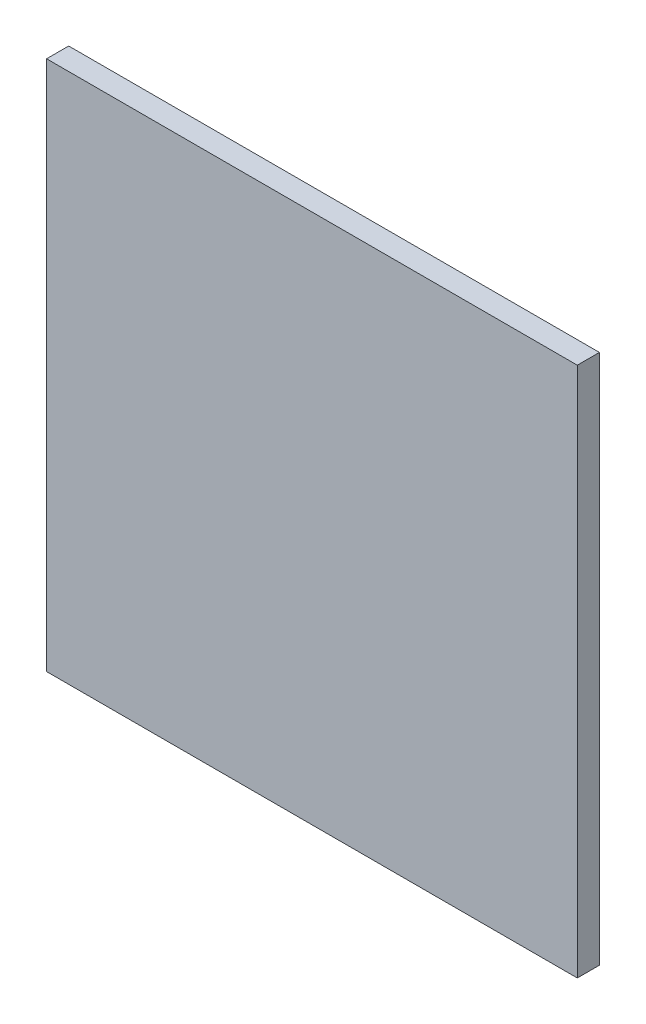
ISO-10303-21;
HEADER;
FILE_DESCRIPTION(('STEP AP214'),'2;1');
FILE_NAME('part.step','',(''),(''),'','','');
FILE_SCHEMA(('AUTOMOTIVE_DESIGN { 1 0 10303 214 1 1 1 1 }'));
ENDSEC;
DATA;
#1=APPLICATION_CONTEXT('core data for automotive mechanical design processes');
#2=APPLICATION_PROTOCOL_DEFINITION('international standard','automotive_design',2000,#1);
#3=PRODUCT_CONTEXT('',#1,'mechanical');
#4=PRODUCT('Part','Part','',(#3));
#5=PRODUCT_RELATED_PRODUCT_CATEGORY('part','',(#4));
#6=PRODUCT_DEFINITION_FORMATION('','',#4);
#7=PRODUCT_DEFINITION_CONTEXT('part definition',#1,'design');
#8=PRODUCT_DEFINITION('design','',#6,#7);
#9=PRODUCT_DEFINITION_SHAPE('','',#8);
#10=(LENGTH_UNIT() NAMED_UNIT(*) SI_UNIT(.MILLI.,.METRE.));
#11=(NAMED_UNIT(*) PLANE_ANGLE_UNIT() SI_UNIT($,.RADIAN.));
#12=(NAMED_UNIT(*) SI_UNIT($,.STERADIAN.) SOLID_ANGLE_UNIT());
#13=UNCERTAINTY_MEASURE_WITH_UNIT(LENGTH_MEASURE(1.E-05),#10,'distance_accuracy_value','');
#14=(GEOMETRIC_REPRESENTATION_CONTEXT(3) GLOBAL_UNCERTAINTY_ASSIGNED_CONTEXT((#13)) GLOBAL_UNIT_ASSIGNED_CONTEXT((#10,
#11,#12)) REPRESENTATION_CONTEXT('',''));
#15=CARTESIAN_POINT('',(0.,0.,0.));
#16=DIRECTION('',(0.,0.,1.));
#17=DIRECTION('',(1.,0.,0.));
#18=AXIS2_PLACEMENT_3D('',#15,#16,#17);
#19=CARTESIAN_POINT('',(-38.1,38.1,1.5875));
#20=DIRECTION('',(0.,0.,1.));
#21=DIRECTION('',(1.,0.,0.));
#22=AXIS2_PLACEMENT_3D('',#19,#20,#21);
#23=PLANE('',#22);
#24=DIRECTION('',(1.,0.,0.));
#25=VECTOR('',#24,1.);
#26=CARTESIAN_POINT('',(38.1,-38.1,1.5875));
#27=LINE('',#26,#25);
#28=CARTESIAN_POINT('',(38.1,-38.1,1.5875));
#29=VERTEX_POINT('',#28);
#30=CARTESIAN_POINT('',(-38.1,-38.1,1.5875));
#31=VERTEX_POINT('',#30);
#32=EDGE_CURVE('E19',#29,#31,#27,.F.);
#33=ORIENTED_EDGE('',*,*,#32,.F.);
#34=DIRECTION('',(0.,1.,0.));
#35=VECTOR('',#34,1.);
#36=CARTESIAN_POINT('',(38.1,38.1,1.5875));
#37=LINE('',#36,#35);
#38=CARTESIAN_POINT('',(38.1,38.1,1.5875));
#39=VERTEX_POINT('',#38);
#40=EDGE_CURVE('E57',#39,#29,#37,.F.);
#41=ORIENTED_EDGE('',*,*,#40,.F.);
#42=DIRECTION('',(1.,0.,0.));
#43=VECTOR('',#42,1.);
#44=CARTESIAN_POINT('',(-38.1,38.1,1.5875));
#45=LINE('',#44,#43);
#46=CARTESIAN_POINT('',(-38.1,38.1,1.5875));
#47=VERTEX_POINT('',#46);
#48=EDGE_CURVE('E52',#47,#39,#45,.T.);
#49=ORIENTED_EDGE('',*,*,#48,.F.);
#50=DIRECTION('',(0.,1.,0.));
#51=VECTOR('',#50,1.);
#52=CARTESIAN_POINT('',(-38.1,-38.1,1.5875));
#53=LINE('',#52,#51);
#54=EDGE_CURVE('E67',#31,#47,#53,.T.);
#55=ORIENTED_EDGE('',*,*,#54,.F.);
#56=EDGE_LOOP('',(#33,#41,#49,#55));
#57=FACE_BOUND('',#56,.T.);
#58=ADVANCED_FACE('F16',(#57),#23,.T.);
#59=CARTESIAN_POINT('',(38.1,-38.1,-1.5875));
#60=DIRECTION('',(0.,-1.,0.));
#61=DIRECTION('',(0.,0.,-1.));
#62=AXIS2_PLACEMENT_3D('',#59,#60,#61);
#63=PLANE('',#62);
#64=DIRECTION('',(1.,0.,0.));
#65=VECTOR('',#64,1.);
#66=CARTESIAN_POINT('',(0.,-38.1,-1.5875));
#67=LINE('',#66,#65);
#68=CARTESIAN_POINT('',(-38.1,-38.1,-1.5875));
#69=VERTEX_POINT('',#68);
#70=CARTESIAN_POINT('',(38.1,-38.1,-1.5875));
#71=VERTEX_POINT('',#70);
#72=EDGE_CURVE('E73',#69,#71,#67,.T.);
#73=ORIENTED_EDGE('',*,*,#72,.T.);
#74=DIRECTION('',(0.,0.,-1.));
#75=VECTOR('',#74,1.);
#76=CARTESIAN_POINT('',(38.1,-38.1,-1.5875));
#77=LINE('',#76,#75);
#78=EDGE_CURVE('E62',#29,#71,#77,.T.);
#79=ORIENTED_EDGE('',*,*,#78,.F.);
#80=ORIENTED_EDGE('',*,*,#32,.T.);
#81=DIRECTION('',(0.,0.,1.));
#82=VECTOR('',#81,1.);
#83=CARTESIAN_POINT('',(-38.1,-38.1,-1.5875));
#84=LINE('',#83,#82);
#85=EDGE_CURVE('E80',#69,#31,#84,.T.);
#86=ORIENTED_EDGE('',*,*,#85,.F.);
#87=EDGE_LOOP('',(#73,#79,#80,#86));
#88=FACE_BOUND('',#87,.T.);
#89=ADVANCED_FACE('F72',(#88),#63,.T.);
#90=CARTESIAN_POINT('',(38.1,38.1,-1.5875));
#91=DIRECTION('',(1.,0.,0.));
#92=DIRECTION('',(0.,0.,-1.));
#93=AXIS2_PLACEMENT_3D('',#90,#91,#92);
#94=PLANE('',#93);
#95=DIRECTION('',(0.,1.,0.));
#96=VECTOR('',#95,1.);
#97=CARTESIAN_POINT('',(38.1,0.,-1.5875));
#98=LINE('',#97,#96);
#99=CARTESIAN_POINT('',(38.1,38.1,-1.5875));
#100=VERTEX_POINT('',#99);
#101=EDGE_CURVE('E83',#71,#100,#98,.T.);
#102=ORIENTED_EDGE('',*,*,#101,.T.);
#103=DIRECTION('',(0.,0.,1.));
#104=VECTOR('',#103,1.);
#105=CARTESIAN_POINT('',(38.1,38.1,-1.5875));
#106=LINE('',#105,#104);
#107=EDGE_CURVE('E64',#39,#100,#106,.F.);
#108=ORIENTED_EDGE('',*,*,#107,.F.);
#109=ORIENTED_EDGE('',*,*,#40,.T.);
#110=ORIENTED_EDGE('',*,*,#78,.T.);
#111=EDGE_LOOP('',(#102,#108,#109,#110));
#112=FACE_BOUND('',#111,.T.);
#113=ADVANCED_FACE('F60',(#112),#94,.T.);
#114=CARTESIAN_POINT('',(-38.1,38.1,-1.5875));
#115=DIRECTION('',(0.,1.,0.));
#116=DIRECTION('',(0.,0.,1.));
#117=AXIS2_PLACEMENT_3D('',#114,#115,#116);
#118=PLANE('',#117);
#119=DIRECTION('',(1.,0.,0.));
#120=VECTOR('',#119,1.);
#121=CARTESIAN_POINT('',(0.,38.1,-1.5875));
#122=LINE('',#121,#120);
#123=CARTESIAN_POINT('',(-38.1,38.1,-1.5875));
#124=VERTEX_POINT('',#123);
#125=EDGE_CURVE('E25',#100,#124,#122,.F.);
#126=ORIENTED_EDGE('',*,*,#125,.T.);
#127=DIRECTION('',(0.,0.,1.));
#128=VECTOR('',#127,1.);
#129=CARTESIAN_POINT('',(-38.1,38.1,-1.5875));
#130=LINE('',#129,#128);
#131=EDGE_CURVE('E33',#47,#124,#130,.F.);
#132=ORIENTED_EDGE('',*,*,#131,.F.);
#133=ORIENTED_EDGE('',*,*,#48,.T.);
#134=ORIENTED_EDGE('',*,*,#107,.T.);
#135=EDGE_LOOP('',(#126,#132,#133,#134));
#136=FACE_BOUND('',#135,.T.);
#137=ADVANCED_FACE('F87',(#136),#118,.T.);
#138=CARTESIAN_POINT('',(-38.1,-38.1,-1.5875));
#139=DIRECTION('',(-1.,0.,0.));
#140=DIRECTION('',(0.,0.,1.));
#141=AXIS2_PLACEMENT_3D('',#138,#139,#140);
#142=PLANE('',#141);
#143=DIRECTION('',(0.,1.,0.));
#144=VECTOR('',#143,1.);
#145=CARTESIAN_POINT('',(-38.1,0.,-1.5875));
#146=LINE('',#145,#144);
#147=EDGE_CURVE('E11',#124,#69,#146,.F.);
#148=ORIENTED_EDGE('',*,*,#147,.T.);
#149=ORIENTED_EDGE('',*,*,#85,.T.);
#150=ORIENTED_EDGE('',*,*,#54,.T.);
#151=ORIENTED_EDGE('',*,*,#131,.T.);
#152=EDGE_LOOP('',(#148,#149,#150,#151));
#153=FACE_BOUND('',#152,.T.);
#154=ADVANCED_FACE('F90',(#153),#142,.T.);
#155=CARTESIAN_POINT('',(0.,0.,-1.5875));
#156=DIRECTION('',(0.,0.,1.));
#157=DIRECTION('',(1.,0.,0.));
#158=AXIS2_PLACEMENT_3D('',#155,#156,#157);
#159=PLANE('',#158);
#160=ORIENTED_EDGE('',*,*,#125,.F.);
#161=ORIENTED_EDGE('',*,*,#101,.F.);
#162=ORIENTED_EDGE('',*,*,#72,.F.);
#163=ORIENTED_EDGE('',*,*,#147,.F.);
#164=EDGE_LOOP('',(#160,#161,#162,#163));
#165=FACE_BOUND('',#164,.T.);
#166=ADVANCED_FACE('F89',(#165),#159,.F.);
#167=CLOSED_SHELL('',(#58,#89,#113,#137,#154,#166));
#168=MANIFOLD_SOLID_BREP('B1',#167);
#169=ADVANCED_BREP_SHAPE_REPRESENTATION('',(#18,#168),#14);
#170=SHAPE_DEFINITION_REPRESENTATION(#9,#169);
ENDSEC;
END-ISO-10303-21;
